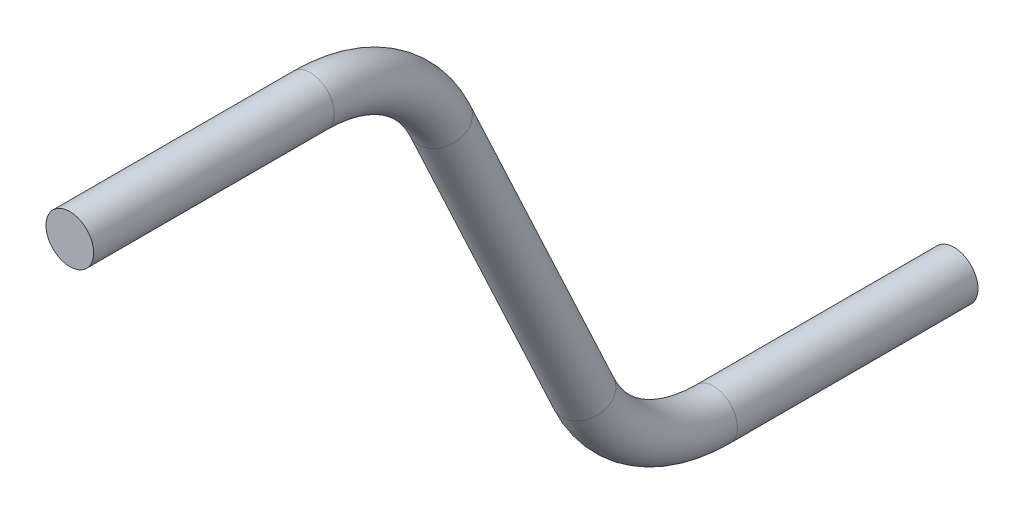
from build123d import *

# Parameters (mm, degrees)
SKETCH1_R      = 1.5875
EXTRUDE1_DEPTH = 16.002
SKETCH2_R      = 1.5875


with BuildPart() as part:
    # Sketch1 → Extrude1 (new body)
    with BuildSketch(Plane.XY):
        Circle(SKETCH1_R)
    extrude(amount=EXTRUDE1_DEPTH)

    # Sweep1: sweep along a path in sweep_sketch
    with BuildLine(Plane(origin=(0, 0, 0), x_dir=(0, 0, -1), z_dir=(1, 0, 0))) as sweep1_path:
        Line((-58.813768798, 31.467594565), (-42.811768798, 31.467594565))
        ThreePointArc((-42.811768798, 31.467594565), (-37.693990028, 29.975898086), (-34.179187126, 25.968033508))
        Line((-34.179187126, 25.968033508), (-24.634581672, 5.499561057))
        ThreePointArc((-24.634581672, 5.499561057), (-21.11977877, 1.491696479), (-16.002, 0))
    # Sketch2 → Sweep1 (sweep)
    with BuildSketch(Plane.XY.offset(16.002)):
        Circle(SKETCH2_R)
    sweep(path=sweep1_path.line)


solid = part.part
